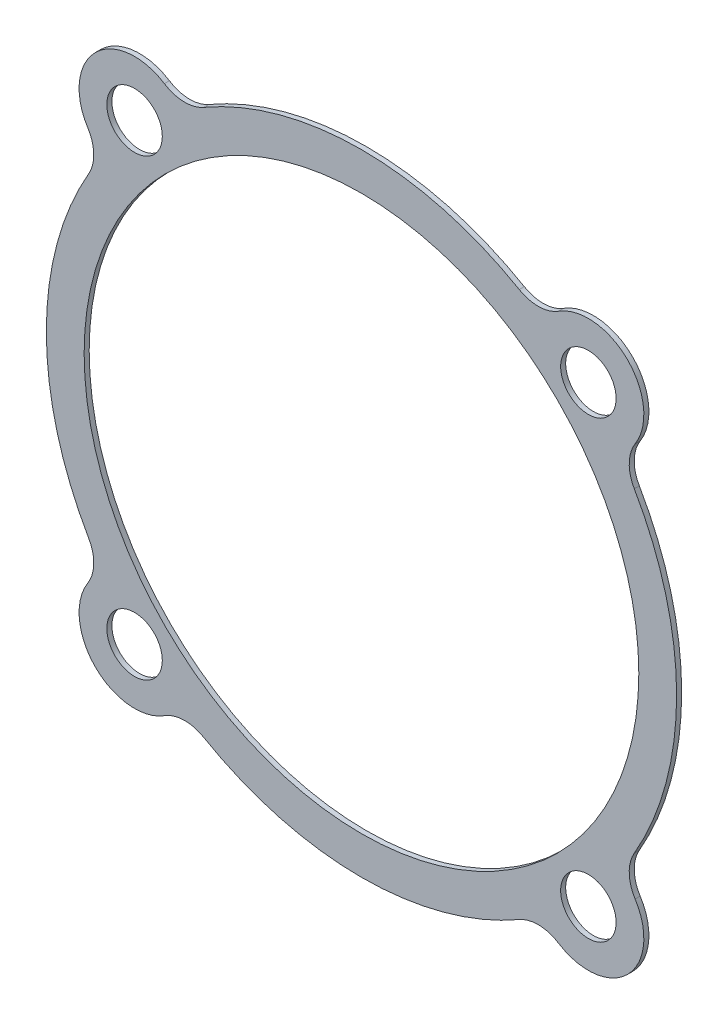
from build123d import *

# Parameters (mm, degrees)
ESQUISSE1_R          = 1.1
ESQUISSE1_R_2        = 11
BASE_EXTRUSION_DEPTH = 0.2


with BuildPart() as part:
    # Esquisse1 → Base-Extrusion (new body)
    with BuildSketch(Plane(origin=(0, 0, -0.2), x_dir=(-1, 0, 0), z_dir=(0, 0, -1))):
        with BuildLine():
            ThreePointArc((10.854487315, 7.816413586), (10.555634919, 10.555634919), (7.816413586, 10.854487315))
            ThreePointArc((7.816413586, 10.854487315), (7.042179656, 10.619268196), (6.258413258, 10.820455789))
            ThreePointArc((6.258413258, 10.820455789), (0, 12.5), (-6.258413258, 10.820455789))
            ThreePointArc((-6.258413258, 10.820455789), (-7.042179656, 10.619268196), (-7.816413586, 10.854487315))
            ThreePointArc((-7.816413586, 10.854487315), (-10.555634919, 10.555634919), (-10.854487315, 7.816413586))
            ThreePointArc((-10.854487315, 7.816413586), (-10.619268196, 7.042179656), (-10.820455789, 6.258413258))
            ThreePointArc((-10.820455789, 6.258413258), (-12.5, 0), (-10.820455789, -6.258413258))
            ThreePointArc((-10.820455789, -6.258413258), (-10.619268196, -7.042179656), (-10.854487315, -7.816413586))
            ThreePointArc((-10.854487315, -7.816413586), (-10.555634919, -10.555634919), (-7.816413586, -10.854487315))
            ThreePointArc((-7.816413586, -10.854487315), (-7.042179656, -10.619268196), (-6.258413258, -10.820455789))
            ThreePointArc((-6.258413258, -10.820455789), (0, -12.5), (6.258413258, -10.820455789))
            ThreePointArc((6.258413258, -10.820455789), (7.042179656, -10.619268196), (7.816413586, -10.854487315))
            ThreePointArc((7.816413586, -10.854487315), (10.555634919, -10.555634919), (10.854487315, -7.816413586))
            ThreePointArc((10.854487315, -7.816413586), (10.619268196, -7.042179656), (10.820455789, -6.258413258))
            ThreePointArc((10.820455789, -6.258413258), (12.5, 0), (10.820455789, 6.258413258))
            ThreePointArc((10.820455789, 6.258413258), (10.619268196, 7.042179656), (10.854487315, 7.816413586))
        make_face()
        with Locations(Location((9, -9, 0), (0, 0, 180))):
            Circle(ESQUISSE1_R, mode=Mode.SUBTRACT)
        with Locations(Location((-9, -9, 0), (0, 0, 180))):
            Circle(ESQUISSE1_R, mode=Mode.SUBTRACT)
        with Locations(Location((9, 9, 0), (0, 0, 180))):
            Circle(ESQUISSE1_R, mode=Mode.SUBTRACT)
        with Locations(Location((-9, 9, 0), (0, 0, 180))):
            Circle(ESQUISSE1_R, mode=Mode.SUBTRACT)
        with Locations(Location((0, 0, 0), (0, 0, 180))):
            Circle(ESQUISSE1_R_2, mode=Mode.SUBTRACT)
    extrude(amount=-BASE_EXTRUSION_DEPTH)


solid = part.part
